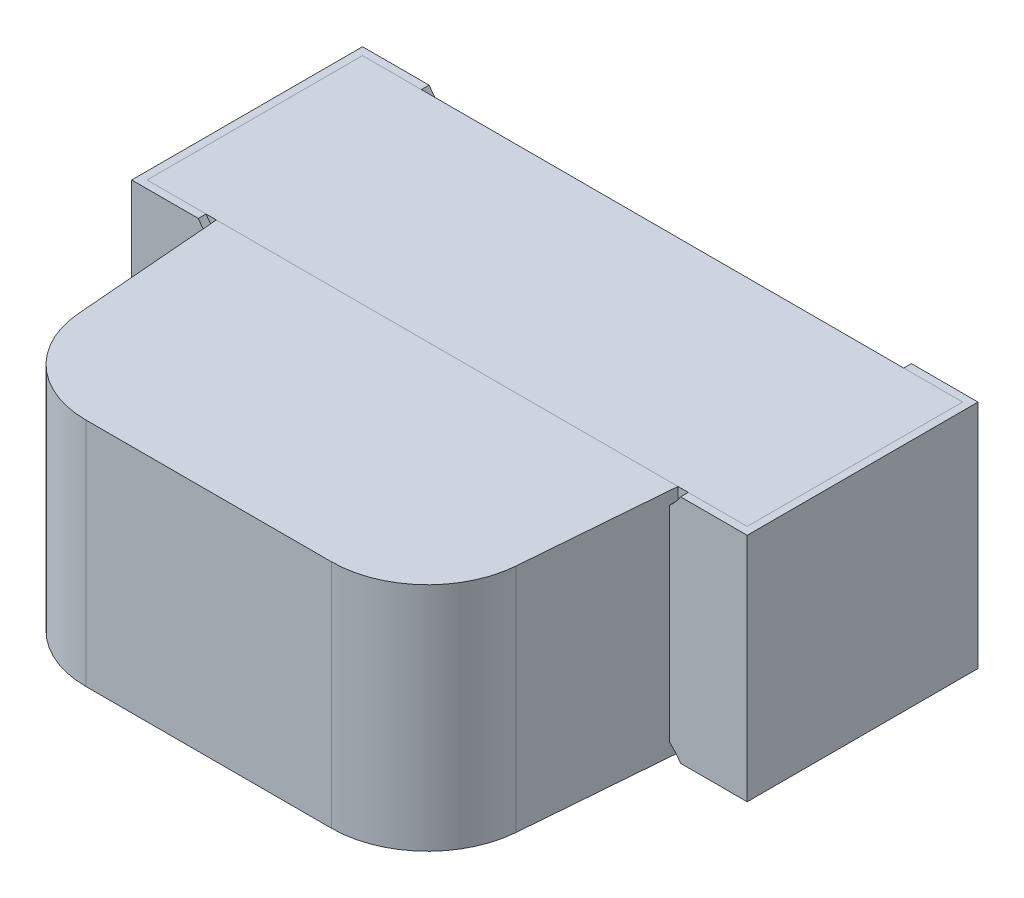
ISO-10303-21;
HEADER;
FILE_DESCRIPTION(('STEP AP214'),'2;1');
FILE_NAME('part.step','',(''),(''),'','','');
FILE_SCHEMA(('AUTOMOTIVE_DESIGN { 1 0 10303 214 1 1 1 1 }'));
ENDSEC;
DATA;
#1=APPLICATION_CONTEXT('core data for automotive mechanical design processes');
#2=APPLICATION_PROTOCOL_DEFINITION('international standard','automotive_design',2000,#1);
#3=PRODUCT_CONTEXT('',#1,'mechanical');
#4=PRODUCT('Part','Part','',(#3));
#5=PRODUCT_RELATED_PRODUCT_CATEGORY('part','',(#4));
#6=PRODUCT_DEFINITION_FORMATION('','',#4);
#7=PRODUCT_DEFINITION_CONTEXT('part definition',#1,'design');
#8=PRODUCT_DEFINITION('design','',#6,#7);
#9=PRODUCT_DEFINITION_SHAPE('','',#8);
#10=(LENGTH_UNIT() NAMED_UNIT(*) SI_UNIT(.MILLI.,.METRE.));
#11=(NAMED_UNIT(*) PLANE_ANGLE_UNIT() SI_UNIT($,.RADIAN.));
#12=(NAMED_UNIT(*) SI_UNIT($,.STERADIAN.) SOLID_ANGLE_UNIT());
#13=UNCERTAINTY_MEASURE_WITH_UNIT(LENGTH_MEASURE(1.E-05),#10,'distance_accuracy_value','');
#14=(GEOMETRIC_REPRESENTATION_CONTEXT(3) GLOBAL_UNCERTAINTY_ASSIGNED_CONTEXT((#13)) GLOBAL_UNIT_ASSIGNED_CONTEXT((#10,
#11,#12)) REPRESENTATION_CONTEXT('',''));
#15=CARTESIAN_POINT('',(0.,0.,0.));
#16=DIRECTION('',(0.,0.,1.));
#17=DIRECTION('',(1.,0.,0.));
#18=AXIS2_PLACEMENT_3D('',#15,#16,#17);
#19=CARTESIAN_POINT('',(-0.6,0.6,0.28));
#20=DIRECTION('',(0.996763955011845,0.,-0.08038418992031));
#21=DIRECTION('',(-0.08038418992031,0.,-0.996763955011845));
#22=AXIS2_PLACEMENT_3D('',#19,#20,#21);
#23=PLANE('',#22);
#24=DIRECTION('',(0.08038418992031,0.,0.996763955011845));
#25=VECTOR('',#24,1.);
#26=CARTESIAN_POINT('',(-0.6,0.,0.28));
#27=LINE('',#26,#25);
#28=CARTESIAN_POINT('',(-0.6,0.,0.28));
#29=VERTEX_POINT('',#28);
#30=CARTESIAN_POINT('',(-0.568540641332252,0.,0.670096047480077));
#31=VERTEX_POINT('',#30);
#32=EDGE_CURVE('E138',#29,#31,#27,.T.);
#33=ORIENTED_EDGE('',*,*,#32,.T.);
#34=DIRECTION('',(0.,-1.,0.));
#35=VECTOR('',#34,1.);
#36=CARTESIAN_POINT('',(-0.568540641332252,0.6,0.670096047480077));
#37=LINE('',#36,#35);
#38=CARTESIAN_POINT('',(-0.568540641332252,0.6,0.670096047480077));
#39=VERTEX_POINT('',#38);
#40=EDGE_CURVE('E12',#39,#31,#37,.T.);
#41=ORIENTED_EDGE('',*,*,#40,.F.);
#42=DIRECTION('',(0.08038418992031,0.,0.996763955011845));
#43=VECTOR('',#42,1.);
#44=CARTESIAN_POINT('',(-0.6,0.6,0.28));
#45=LINE('',#44,#43);
#46=CARTESIAN_POINT('',(-0.6,0.6,0.28));
#47=VERTEX_POINT('',#46);
#48=EDGE_CURVE('E153',#47,#39,#45,.T.);
#49=ORIENTED_EDGE('',*,*,#48,.F.);
#50=DIRECTION('',(0.,-1.,0.));
#51=VECTOR('',#50,1.);
#52=CARTESIAN_POINT('',(-0.6,0.6,0.28));
#53=LINE('',#52,#51);
#54=EDGE_CURVE('E134',#47,#29,#53,.T.);
#55=ORIENTED_EDGE('',*,*,#54,.T.);
#56=EDGE_LOOP('',(#33,#41,#49,#55));
#57=FACE_BOUND('',#56,.T.);
#58=ADVANCED_FACE('F47',(#57),#23,.F.);
#59=CARTESIAN_POINT('',(-0.31934965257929,0.6,0.65));
#60=DIRECTION('',(0.,-1.,0.));
#61=DIRECTION('',(0.,0.,-1.));
#62=AXIS2_PLACEMENT_3D('',#59,#60,#61);
#63=CYLINDRICAL_SURFACE('',#62,0.25);
#64=CARTESIAN_POINT('',(-0.31934965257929,0.,0.65));
#65=DIRECTION('',(0.,1.,0.));
#66=DIRECTION('',(0.,0.,1.));
#67=AXIS2_PLACEMENT_3D('',#64,#65,#66);
#68=CIRCLE('',#67,0.25);
#69=CARTESIAN_POINT('',(-0.31934965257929,0.,0.9));
#70=VERTEX_POINT('',#69);
#71=EDGE_CURVE('E142',#31,#70,#68,.T.);
#72=ORIENTED_EDGE('',*,*,#71,.T.);
#73=DIRECTION('',(0.,-1.,0.));
#74=VECTOR('',#73,1.);
#75=CARTESIAN_POINT('',(-0.31934965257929,0.6,0.9));
#76=LINE('',#75,#74);
#77=CARTESIAN_POINT('',(-0.31934965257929,0.6,0.9));
#78=VERTEX_POINT('',#77);
#79=EDGE_CURVE('E56',#78,#70,#76,.T.);
#80=ORIENTED_EDGE('',*,*,#79,.F.);
#81=CARTESIAN_POINT('',(-0.31934965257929,0.6,0.65));
#82=DIRECTION('',(0.,1.,0.));
#83=DIRECTION('',(0.,0.,1.));
#84=AXIS2_PLACEMENT_3D('',#81,#82,#83);
#85=CIRCLE('',#84,0.25);
#86=EDGE_CURVE('E101',#39,#78,#85,.T.);
#87=ORIENTED_EDGE('',*,*,#86,.F.);
#88=ORIENTED_EDGE('',*,*,#40,.T.);
#89=EDGE_LOOP('',(#72,#80,#87,#88));
#90=FACE_BOUND('',#89,.T.);
#91=ADVANCED_FACE('F180',(#90),#63,.T.);
#92=CARTESIAN_POINT('',(-0.31934965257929,0.6,0.9));
#93=DIRECTION('',(0.,0.,-1.));
#94=DIRECTION('',(-1.,0.,0.));
#95=AXIS2_PLACEMENT_3D('',#92,#93,#94);
#96=PLANE('',#95);
#97=DIRECTION('',(1.,0.,0.));
#98=VECTOR('',#97,1.);
#99=CARTESIAN_POINT('',(-0.31934965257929,0.,0.9));
#100=LINE('',#99,#98);
#101=CARTESIAN_POINT('',(0.319349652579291,0.,0.9));
#102=VERTEX_POINT('',#101);
#103=EDGE_CURVE('E145',#70,#102,#100,.T.);
#104=ORIENTED_EDGE('',*,*,#103,.T.);
#105=DIRECTION('',(0.,-1.,0.));
#106=VECTOR('',#105,1.);
#107=CARTESIAN_POINT('',(0.319349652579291,0.6,0.9));
#108=LINE('',#107,#106);
#109=CARTESIAN_POINT('',(0.319349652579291,0.6,0.9));
#110=VERTEX_POINT('',#109);
#111=EDGE_CURVE('E125',#110,#102,#108,.T.);
#112=ORIENTED_EDGE('',*,*,#111,.F.);
#113=DIRECTION('',(1.,0.,0.));
#114=VECTOR('',#113,1.);
#115=CARTESIAN_POINT('',(-0.31934965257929,0.6,0.9));
#116=LINE('',#115,#114);
#117=EDGE_CURVE('E114',#78,#110,#116,.T.);
#118=ORIENTED_EDGE('',*,*,#117,.F.);
#119=ORIENTED_EDGE('',*,*,#79,.T.);
#120=EDGE_LOOP('',(#104,#112,#118,#119));
#121=FACE_BOUND('',#120,.T.);
#122=ADVANCED_FACE('F163',(#121),#96,.F.);
#123=CARTESIAN_POINT('',(0.31934965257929,0.6,0.65));
#124=DIRECTION('',(0.,-1.,0.));
#125=DIRECTION('',(0.,0.,-1.));
#126=AXIS2_PLACEMENT_3D('',#123,#124,#125);
#127=CYLINDRICAL_SURFACE('',#126,0.25);
#128=CARTESIAN_POINT('',(0.31934965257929,0.,0.65));
#129=DIRECTION('',(0.,1.,0.));
#130=DIRECTION('',(0.,0.,1.));
#131=AXIS2_PLACEMENT_3D('',#128,#129,#130);
#132=CIRCLE('',#131,0.25);
#133=CARTESIAN_POINT('',(0.568540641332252,0.,0.670096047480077));
#134=VERTEX_POINT('',#133);
#135=EDGE_CURVE('E123',#102,#134,#132,.T.);
#136=ORIENTED_EDGE('',*,*,#135,.T.);
#137=DIRECTION('',(0.,-1.,0.));
#138=VECTOR('',#137,1.);
#139=CARTESIAN_POINT('',(0.568540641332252,0.6,0.670096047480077));
#140=LINE('',#139,#138);
#141=CARTESIAN_POINT('',(0.568540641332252,0.6,0.670096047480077));
#142=VERTEX_POINT('',#141);
#143=EDGE_CURVE('E120',#142,#134,#140,.T.);
#144=ORIENTED_EDGE('',*,*,#143,.F.);
#145=CARTESIAN_POINT('',(0.31934965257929,0.6,0.65));
#146=DIRECTION('',(0.,1.,0.));
#147=DIRECTION('',(0.,0.,1.));
#148=AXIS2_PLACEMENT_3D('',#145,#146,#147);
#149=CIRCLE('',#148,0.25);
#150=EDGE_CURVE('E108',#110,#142,#149,.T.);
#151=ORIENTED_EDGE('',*,*,#150,.F.);
#152=ORIENTED_EDGE('',*,*,#111,.T.);
#153=EDGE_LOOP('',(#136,#144,#151,#152));
#154=FACE_BOUND('',#153,.T.);
#155=ADVANCED_FACE('F121',(#154),#127,.T.);
#156=CARTESIAN_POINT('',(0.6,0.6,0.28));
#157=DIRECTION('',(-0.996763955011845,0.,-0.0803841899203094));
#158=DIRECTION('',(-0.0803841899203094,0.,0.996763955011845));
#159=AXIS2_PLACEMENT_3D('',#156,#157,#158);
#160=PLANE('',#159);
#161=DIRECTION('',(0.0803841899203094,0.,-0.996763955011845));
#162=VECTOR('',#161,1.);
#163=CARTESIAN_POINT('',(0.6,0.,0.28));
#164=LINE('',#163,#162);
#165=CARTESIAN_POINT('',(0.6,0.,0.28));
#166=VERTEX_POINT('',#165);
#167=EDGE_CURVE('E87',#134,#166,#164,.T.);
#168=ORIENTED_EDGE('',*,*,#167,.T.);
#169=DIRECTION('',(0.,-1.,0.));
#170=VECTOR('',#169,1.);
#171=CARTESIAN_POINT('',(0.6,0.6,0.28));
#172=LINE('',#171,#170);
#173=CARTESIAN_POINT('',(0.6,0.6,0.28));
#174=VERTEX_POINT('',#173);
#175=EDGE_CURVE('E126',#174,#166,#172,.T.);
#176=ORIENTED_EDGE('',*,*,#175,.F.);
#177=DIRECTION('',(0.0803841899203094,0.,-0.996763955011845));
#178=VECTOR('',#177,1.);
#179=CARTESIAN_POINT('',(0.6,0.6,0.28));
#180=LINE('',#179,#178);
#181=EDGE_CURVE('E112',#142,#174,#180,.T.);
#182=ORIENTED_EDGE('',*,*,#181,.F.);
#183=ORIENTED_EDGE('',*,*,#143,.T.);
#184=EDGE_LOOP('',(#168,#176,#182,#183));
#185=FACE_BOUND('',#184,.T.);
#186=ADVANCED_FACE('F128',(#185),#160,.F.);
#187=CARTESIAN_POINT('',(-0.6,0.6,0.28));
#188=DIRECTION('',(0.,0.,1.));
#189=DIRECTION('',(1.,0.,0.));
#190=AXIS2_PLACEMENT_3D('',#187,#188,#189);
#191=PLANE('',#190);
#192=DIRECTION('',(-1.,0.,0.));
#193=VECTOR('',#192,1.);
#194=CARTESIAN_POINT('',(-0.6,0.,0.28));
#195=LINE('',#194,#193);
#196=EDGE_CURVE('E93',#166,#29,#195,.T.);
#197=ORIENTED_EDGE('',*,*,#196,.T.);
#198=ORIENTED_EDGE('',*,*,#54,.F.);
#199=DIRECTION('',(-1.,0.,0.));
#200=VECTOR('',#199,1.);
#201=CARTESIAN_POINT('',(-0.6,0.6,0.28));
#202=LINE('',#201,#200);
#203=EDGE_CURVE('E64',#174,#47,#202,.T.);
#204=ORIENTED_EDGE('',*,*,#203,.F.);
#205=ORIENTED_EDGE('',*,*,#175,.T.);
#206=EDGE_LOOP('',(#197,#198,#204,#205));
#207=FACE_BOUND('',#206,.T.);
#208=ADVANCED_FACE('F170',(#207),#191,.F.);
#209=CARTESIAN_POINT('',(-0.31934965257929,0.6,0.65));
#210=DIRECTION('',(0.,1.,0.));
#211=DIRECTION('',(0.,0.,1.));
#212=AXIS2_PLACEMENT_3D('',#209,#210,#211);
#213=PLANE('',#212);
#214=ORIENTED_EDGE('',*,*,#48,.T.);
#215=ORIENTED_EDGE('',*,*,#86,.T.);
#216=ORIENTED_EDGE('',*,*,#117,.T.);
#217=ORIENTED_EDGE('',*,*,#150,.T.);
#218=ORIENTED_EDGE('',*,*,#181,.T.);
#219=ORIENTED_EDGE('',*,*,#203,.T.);
#220=EDGE_LOOP('',(#214,#215,#216,#217,#218,#219));
#221=FACE_BOUND('',#220,.T.);
#222=ADVANCED_FACE('F110',(#221),#213,.T.);
#223=CARTESIAN_POINT('',(-0.31934965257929,0.,0.65));
#224=DIRECTION('',(0.,1.,0.));
#225=DIRECTION('',(0.,0.,1.));
#226=AXIS2_PLACEMENT_3D('',#223,#224,#225);
#227=PLANE('',#226);
#228=ORIENTED_EDGE('',*,*,#32,.F.);
#229=ORIENTED_EDGE('',*,*,#196,.F.);
#230=ORIENTED_EDGE('',*,*,#167,.F.);
#231=ORIENTED_EDGE('',*,*,#135,.F.);
#232=ORIENTED_EDGE('',*,*,#103,.F.);
#233=ORIENTED_EDGE('',*,*,#71,.F.);
#234=EDGE_LOOP('',(#228,#229,#230,#231,#232,#233));
#235=FACE_BOUND('',#234,.T.);
#236=ADVANCED_FACE('F166',(#235),#227,.F.);
#237=CLOSED_SHELL('',(#58,#91,#122,#155,#186,#208,#222,#236));
#238=MANIFOLD_SOLID_BREP('B2',#237);
#239=CARTESIAN_POINT('',(0.78,0.6,0.28));
#240=DIRECTION('',(1.,0.,0.));
#241=DIRECTION('',(0.,0.,-1.));
#242=AXIS2_PLACEMENT_3D('',#239,#240,#241);
#243=PLANE('',#242);
#244=DIRECTION('',(0.,0.,1.));
#245=VECTOR('',#244,1.);
#246=CARTESIAN_POINT('',(0.78,0.,0.28));
#247=LINE('',#246,#245);
#248=CARTESIAN_POINT('',(0.78,0.,-0.28));
#249=VERTEX_POINT('',#248);
#250=CARTESIAN_POINT('',(0.78,0.,0.28));
#251=VERTEX_POINT('',#250);
#252=EDGE_CURVE('E382',#249,#251,#247,.T.);
#253=ORIENTED_EDGE('',*,*,#252,.T.);
#254=DIRECTION('',(0.,-1.,0.));
#255=VECTOR('',#254,1.);
#256=CARTESIAN_POINT('',(0.78,0.6,0.28));
#257=LINE('',#256,#255);
#258=CARTESIAN_POINT('',(0.78,0.6,0.28));
#259=VERTEX_POINT('',#258);
#260=EDGE_CURVE('E419',#259,#251,#257,.T.);
#261=ORIENTED_EDGE('',*,*,#260,.F.);
#262=DIRECTION('',(0.,0.,1.));
#263=VECTOR('',#262,1.);
#264=CARTESIAN_POINT('',(0.78,0.6,0.28));
#265=LINE('',#264,#263);
#266=CARTESIAN_POINT('',(0.78,0.6,-0.28));
#267=VERTEX_POINT('',#266);
#268=EDGE_CURVE('E392',#267,#259,#265,.T.);
#269=ORIENTED_EDGE('',*,*,#268,.F.);
#270=DIRECTION('',(0.,-1.,0.));
#271=VECTOR('',#270,1.);
#272=CARTESIAN_POINT('',(0.78,0.6,-0.28));
#273=LINE('',#272,#271);
#274=EDGE_CURVE('E393',#267,#249,#273,.T.);
#275=ORIENTED_EDGE('',*,*,#274,.T.);
#276=EDGE_LOOP('',(#253,#261,#269,#275));
#277=FACE_BOUND('',#276,.T.);
#278=ADVANCED_FACE('F258',(#277),#243,.F.);
#279=CARTESIAN_POINT('',(0.55,0.6,0.28));
#280=DIRECTION('',(0.,0.,1.));
#281=DIRECTION('',(1.,0.,0.));
#282=AXIS2_PLACEMENT_3D('',#279,#280,#281);
#283=PLANE('',#282);
#284=DIRECTION('',(0.,-1.,0.));
#285=VECTOR('',#284,1.);
#286=CARTESIAN_POINT('',(0.55,0.6,0.28));
#287=LINE('',#286,#285);
#288=CARTESIAN_POINT('',(0.55,0.538578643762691,0.28));
#289=VERTEX_POINT('',#288);
#290=CARTESIAN_POINT('',(0.55,0.0614213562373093,0.28));
#291=VERTEX_POINT('',#290);
#292=EDGE_CURVE('E415',#289,#291,#287,.T.);
#293=ORIENTED_EDGE('',*,*,#292,.F.);
#294=CARTESIAN_POINT('',(0.5,0.68,0.28));
#295=DIRECTION('',(0.,0.,1.));
#296=DIRECTION('',(1.,0.,0.));
#297=AXIS2_PLACEMENT_3D('',#294,#295,#296);
#298=CIRCLE('',#297,0.15);
#299=CARTESIAN_POINT('',(0.626885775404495,0.6,0.28));
#300=VERTEX_POINT('',#299);
#301=EDGE_CURVE('E465',#289,#300,#298,.T.);
#302=ORIENTED_EDGE('',*,*,#301,.T.);
#303=DIRECTION('',(-1.,0.,0.));
#304=VECTOR('',#303,1.);
#305=CARTESIAN_POINT('',(0.55,0.6,0.28));
#306=LINE('',#305,#304);
#307=EDGE_CURVE('E445',#259,#300,#306,.T.);
#308=ORIENTED_EDGE('',*,*,#307,.F.);
#309=ORIENTED_EDGE('',*,*,#260,.T.);
#310=DIRECTION('',(-1.,0.,0.));
#311=VECTOR('',#310,1.);
#312=CARTESIAN_POINT('',(0.55,0.,0.28));
#313=LINE('',#312,#311);
#314=CARTESIAN_POINT('',(0.626885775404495,0.,0.28));
#315=VERTEX_POINT('',#314);
#316=EDGE_CURVE('E374',#251,#315,#313,.T.);
#317=ORIENTED_EDGE('',*,*,#316,.T.);
#318=CARTESIAN_POINT('',(0.5,-0.0800000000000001,0.28));
#319=DIRECTION('',(0.,0.,1.));
#320=DIRECTION('',(1.,0.,0.));
#321=AXIS2_PLACEMENT_3D('',#318,#319,#320);
#322=CIRCLE('',#321,0.15);
#323=EDGE_CURVE('E351',#315,#291,#322,.T.);
#324=ORIENTED_EDGE('',*,*,#323,.T.);
#325=EDGE_LOOP('',(#293,#302,#308,#309,#317,#324));
#326=FACE_BOUND('',#325,.T.);
#327=ADVANCED_FACE('F481',(#326),#283,.F.);
#328=CARTESIAN_POINT('',(0.55,0.6,0.28));
#329=DIRECTION('',(1.,0.,0.));
#330=DIRECTION('',(0.,0.,-1.));
#331=AXIS2_PLACEMENT_3D('',#328,#329,#330);
#332=PLANE('',#331);
#333=DIRECTION('',(0.,-1.,0.));
#334=VECTOR('',#333,1.);
#335=CARTESIAN_POINT('',(0.55,0.6,0.3));
#336=LINE('',#335,#334);
#337=CARTESIAN_POINT('',(0.55,0.538578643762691,0.3));
#338=VERTEX_POINT('',#337);
#339=CARTESIAN_POINT('',(0.55,0.0614213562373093,0.3));
#340=VERTEX_POINT('',#339);
#341=EDGE_CURVE('E365',#338,#340,#336,.T.);
#342=ORIENTED_EDGE('',*,*,#341,.F.);
#343=DIRECTION('',(0.,0.,1.));
#344=VECTOR('',#343,1.);
#345=CARTESIAN_POINT('',(0.55,0.538578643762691,-0.3));
#346=LINE('',#345,#344);
#347=EDGE_CURVE('E460',#338,#289,#346,.F.);
#348=ORIENTED_EDGE('',*,*,#347,.T.);
#349=ORIENTED_EDGE('',*,*,#292,.T.);
#350=DIRECTION('',(0.,0.,1.));
#351=VECTOR('',#350,1.);
#352=CARTESIAN_POINT('',(0.55,0.0614213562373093,-0.3));
#353=LINE('',#352,#351);
#354=EDGE_CURVE('E533',#291,#340,#353,.T.);
#355=ORIENTED_EDGE('',*,*,#354,.T.);
#356=EDGE_LOOP('',(#342,#348,#349,#355));
#357=FACE_BOUND('',#356,.T.);
#358=ADVANCED_FACE('F492',(#357),#332,.F.);
#359=CARTESIAN_POINT('',(0.55,0.6,0.3));
#360=DIRECTION('',(0.,0.,-1.));
#361=DIRECTION('',(-1.,0.,0.));
#362=AXIS2_PLACEMENT_3D('',#359,#360,#361);
#363=PLANE('',#362);
#364=DIRECTION('',(1.,0.,0.));
#365=VECTOR('',#364,1.);
#366=CARTESIAN_POINT('',(0.55,0.6,0.3));
#367=LINE('',#366,#365);
#368=CARTESIAN_POINT('',(0.626885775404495,0.6,0.3));
#369=VERTEX_POINT('',#368);
#370=CARTESIAN_POINT('',(0.8,0.6,0.3));
#371=VERTEX_POINT('',#370);
#372=EDGE_CURVE('E442',#369,#371,#367,.T.);
#373=ORIENTED_EDGE('',*,*,#372,.F.);
#374=CARTESIAN_POINT('',(0.5,0.68,0.3));
#375=DIRECTION('',(0.,0.,1.));
#376=DIRECTION('',(-1.,0.,0.));
#377=AXIS2_PLACEMENT_3D('',#374,#375,#376);
#378=CIRCLE('',#377,0.15);
#379=EDGE_CURVE('E280',#338,#369,#378,.T.);
#380=ORIENTED_EDGE('',*,*,#379,.F.);
#381=ORIENTED_EDGE('',*,*,#341,.T.);
#382=CARTESIAN_POINT('',(0.5,-0.0800000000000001,0.3));
#383=DIRECTION('',(0.,0.,1.));
#384=DIRECTION('',(1.,0.,0.));
#385=AXIS2_PLACEMENT_3D('',#382,#383,#384);
#386=CIRCLE('',#385,0.15);
#387=CARTESIAN_POINT('',(0.626885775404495,0.,0.3));
#388=VERTEX_POINT('',#387);
#389=EDGE_CURVE('E348',#388,#340,#386,.T.);
#390=ORIENTED_EDGE('',*,*,#389,.F.);
#391=DIRECTION('',(1.,0.,0.));
#392=VECTOR('',#391,1.);
#393=CARTESIAN_POINT('',(0.55,0.,0.3));
#394=LINE('',#393,#392);
#395=CARTESIAN_POINT('',(0.8,0.,0.3));
#396=VERTEX_POINT('',#395);
#397=EDGE_CURVE('E362',#388,#396,#394,.T.);
#398=ORIENTED_EDGE('',*,*,#397,.T.);
#399=DIRECTION('',(0.,-1.,0.));
#400=VECTOR('',#399,1.);
#401=CARTESIAN_POINT('',(0.8,0.6,0.3));
#402=LINE('',#401,#400);
#403=EDGE_CURVE('E410',#371,#396,#402,.T.);
#404=ORIENTED_EDGE('',*,*,#403,.F.);
#405=EDGE_LOOP('',(#373,#380,#381,#390,#398,#404));
#406=FACE_BOUND('',#405,.T.);
#407=ADVANCED_FACE('F360',(#406),#363,.F.);
#408=CARTESIAN_POINT('',(0.8,0.6,0.3));
#409=DIRECTION('',(-1.,0.,0.));
#410=DIRECTION('',(0.,0.,1.));
#411=AXIS2_PLACEMENT_3D('',#408,#409,#410);
#412=PLANE('',#411);
#413=DIRECTION('',(0.,0.,-1.));
#414=VECTOR('',#413,1.);
#415=CARTESIAN_POINT('',(0.8,0.,0.3));
#416=LINE('',#415,#414);
#417=CARTESIAN_POINT('',(0.8,0.,-0.3));
#418=VERTEX_POINT('',#417);
#419=EDGE_CURVE('E372',#396,#418,#416,.T.);
#420=ORIENTED_EDGE('',*,*,#419,.T.);
#421=DIRECTION('',(0.,-1.,0.));
#422=VECTOR('',#421,1.);
#423=CARTESIAN_POINT('',(0.8,0.6,-0.3));
#424=LINE('',#423,#422);
#425=CARTESIAN_POINT('',(0.8,0.6,-0.3));
#426=VERTEX_POINT('',#425);
#427=EDGE_CURVE('E406',#426,#418,#424,.T.);
#428=ORIENTED_EDGE('',*,*,#427,.F.);
#429=DIRECTION('',(0.,0.,-1.));
#430=VECTOR('',#429,1.);
#431=CARTESIAN_POINT('',(0.8,0.6,0.3));
#432=LINE('',#431,#430);
#433=EDGE_CURVE('E441',#371,#426,#432,.T.);
#434=ORIENTED_EDGE('',*,*,#433,.F.);
#435=ORIENTED_EDGE('',*,*,#403,.T.);
#436=EDGE_LOOP('',(#420,#428,#434,#435));
#437=FACE_BOUND('',#436,.T.);
#438=ADVANCED_FACE('F440',(#437),#412,.F.);
#439=CARTESIAN_POINT('',(0.8,0.6,-0.3));
#440=DIRECTION('',(0.,0.,1.));
#441=DIRECTION('',(1.,0.,0.));
#442=AXIS2_PLACEMENT_3D('',#439,#440,#441);
#443=PLANE('',#442);
#444=DIRECTION('',(0.,-1.,0.));
#445=VECTOR('',#444,1.);
#446=CARTESIAN_POINT('',(0.55,0.6,-0.3));
#447=LINE('',#446,#445);
#448=CARTESIAN_POINT('',(0.55,0.538578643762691,-0.3));
#449=VERTEX_POINT('',#448);
#450=CARTESIAN_POINT('',(0.55,0.0614213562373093,-0.3));
#451=VERTEX_POINT('',#450);
#452=EDGE_CURVE('E402',#449,#451,#447,.T.);
#453=ORIENTED_EDGE('',*,*,#452,.F.);
#454=CARTESIAN_POINT('',(0.5,0.68,-0.3));
#455=DIRECTION('',(0.,0.,1.));
#456=DIRECTION('',(-1.,0.,0.));
#457=AXIS2_PLACEMENT_3D('',#454,#455,#456);
#458=CIRCLE('',#457,0.15);
#459=CARTESIAN_POINT('',(0.626885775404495,0.6,-0.3));
#460=VERTEX_POINT('',#459);
#461=EDGE_CURVE('E523',#449,#460,#458,.T.);
#462=ORIENTED_EDGE('',*,*,#461,.T.);
#463=DIRECTION('',(-1.,0.,0.));
#464=VECTOR('',#463,1.);
#465=CARTESIAN_POINT('',(0.8,0.6,-0.3));
#466=LINE('',#465,#464);
#467=EDGE_CURVE('E437',#426,#460,#466,.T.);
#468=ORIENTED_EDGE('',*,*,#467,.F.);
#469=ORIENTED_EDGE('',*,*,#427,.T.);
#470=DIRECTION('',(-1.,0.,0.));
#471=VECTOR('',#470,1.);
#472=CARTESIAN_POINT('',(0.8,0.,-0.3));
#473=LINE('',#472,#471);
#474=CARTESIAN_POINT('',(0.626885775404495,0.,-0.3));
#475=VERTEX_POINT('',#474);
#476=EDGE_CURVE('E379',#418,#475,#473,.T.);
#477=ORIENTED_EDGE('',*,*,#476,.T.);
#478=CARTESIAN_POINT('',(0.5,-0.0800000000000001,-0.3));
#479=DIRECTION('',(0.,0.,1.));
#480=DIRECTION('',(1.,0.,0.));
#481=AXIS2_PLACEMENT_3D('',#478,#479,#480);
#482=CIRCLE('',#481,0.15);
#483=EDGE_CURVE('E367',#475,#451,#482,.T.);
#484=ORIENTED_EDGE('',*,*,#483,.T.);
#485=EDGE_LOOP('',(#453,#462,#468,#469,#477,#484));
#486=FACE_BOUND('',#485,.T.);
#487=ADVANCED_FACE('F432',(#486),#443,.F.);
#488=CARTESIAN_POINT('',(0.55,0.6,-0.3));
#489=DIRECTION('',(1.,0.,0.));
#490=DIRECTION('',(0.,0.,-1.));
#491=AXIS2_PLACEMENT_3D('',#488,#489,#490);
#492=PLANE('',#491);
#493=DIRECTION('',(0.,-1.,0.));
#494=VECTOR('',#493,1.);
#495=CARTESIAN_POINT('',(0.55,0.6,-0.28));
#496=LINE('',#495,#494);
#497=CARTESIAN_POINT('',(0.55,0.538578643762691,-0.28));
#498=VERTEX_POINT('',#497);
#499=CARTESIAN_POINT('',(0.55,0.0614213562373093,-0.28));
#500=VERTEX_POINT('',#499);
#501=EDGE_CURVE('E397',#498,#500,#496,.T.);
#502=ORIENTED_EDGE('',*,*,#501,.F.);
#503=DIRECTION('',(0.,0.,1.));
#504=VECTOR('',#503,1.);
#505=CARTESIAN_POINT('',(0.55,0.538578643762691,-0.300000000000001));
#506=LINE('',#505,#504);
#507=EDGE_CURVE('E471',#498,#449,#506,.F.);
#508=ORIENTED_EDGE('',*,*,#507,.T.);
#509=ORIENTED_EDGE('',*,*,#452,.T.);
#510=DIRECTION('',(0.,0.,1.));
#511=VECTOR('',#510,1.);
#512=CARTESIAN_POINT('',(0.55,0.0614213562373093,-0.300000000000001));
#513=LINE('',#512,#511);
#514=EDGE_CURVE('E520',#451,#500,#513,.T.);
#515=ORIENTED_EDGE('',*,*,#514,.T.);
#516=EDGE_LOOP('',(#502,#508,#509,#515));
#517=FACE_BOUND('',#516,.T.);
#518=ADVANCED_FACE('F503',(#517),#492,.F.);
#519=CARTESIAN_POINT('',(0.78,0.6,-0.28));
#520=DIRECTION('',(0.,0.,-1.));
#521=DIRECTION('',(-1.,0.,0.));
#522=AXIS2_PLACEMENT_3D('',#519,#520,#521);
#523=PLANE('',#522);
#524=DIRECTION('',(1.,0.,0.));
#525=VECTOR('',#524,1.);
#526=CARTESIAN_POINT('',(0.78,0.6,-0.28));
#527=LINE('',#526,#525);
#528=CARTESIAN_POINT('',(0.626885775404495,0.6,-0.28));
#529=VERTEX_POINT('',#528);
#530=EDGE_CURVE('E398',#529,#267,#527,.T.);
#531=ORIENTED_EDGE('',*,*,#530,.F.);
#532=CARTESIAN_POINT('',(0.5,0.68,-0.28));
#533=DIRECTION('',(0.,0.,-1.));
#534=DIRECTION('',(-1.,0.,0.));
#535=AXIS2_PLACEMENT_3D('',#532,#533,#534);
#536=CIRCLE('',#535,0.15);
#537=EDGE_CURVE('E273',#529,#498,#536,.T.);
#538=ORIENTED_EDGE('',*,*,#537,.T.);
#539=ORIENTED_EDGE('',*,*,#501,.T.);
#540=CARTESIAN_POINT('',(0.5,-0.0800000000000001,-0.28));
#541=DIRECTION('',(0.,0.,-1.));
#542=DIRECTION('',(-1.,0.,0.));
#543=AXIS2_PLACEMENT_3D('',#540,#541,#542);
#544=CIRCLE('',#543,0.15);
#545=CARTESIAN_POINT('',(0.626885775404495,0.,-0.28));
#546=VERTEX_POINT('',#545);
#547=EDGE_CURVE('E527',#500,#546,#544,.T.);
#548=ORIENTED_EDGE('',*,*,#547,.T.);
#549=DIRECTION('',(1.,0.,0.));
#550=VECTOR('',#549,1.);
#551=CARTESIAN_POINT('',(0.78,0.,-0.28));
#552=LINE('',#551,#550);
#553=EDGE_CURVE('E389',#546,#249,#552,.T.);
#554=ORIENTED_EDGE('',*,*,#553,.T.);
#555=ORIENTED_EDGE('',*,*,#274,.F.);
#556=EDGE_LOOP('',(#531,#538,#539,#548,#554,#555));
#557=FACE_BOUND('',#556,.T.);
#558=ADVANCED_FACE('F506',(#557),#523,.F.);
#559=CARTESIAN_POINT('',(0.,0.6,0.));
#560=DIRECTION('',(0.,1.,0.));
#561=DIRECTION('',(0.,0.,1.));
#562=AXIS2_PLACEMENT_3D('',#559,#560,#561);
#563=PLANE('',#562);
#564=DIRECTION('',(0.,0.,1.));
#565=VECTOR('',#564,1.);
#566=CARTESIAN_POINT('',(0.626885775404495,0.6,-0.3));
#567=LINE('',#566,#565);
#568=EDGE_CURVE('E45',#369,#300,#567,.F.);
#569=ORIENTED_EDGE('',*,*,#568,.F.);
#570=ORIENTED_EDGE('',*,*,#372,.T.);
#571=ORIENTED_EDGE('',*,*,#433,.T.);
#572=ORIENTED_EDGE('',*,*,#467,.T.);
#573=EDGE_CURVE('E261',#529,#460,#567,.F.);
#574=ORIENTED_EDGE('',*,*,#573,.F.);
#575=ORIENTED_EDGE('',*,*,#530,.T.);
#576=ORIENTED_EDGE('',*,*,#268,.T.);
#577=ORIENTED_EDGE('',*,*,#307,.T.);
#578=EDGE_LOOP('',(#569,#570,#571,#572,#574,#575,#576,#577));
#579=FACE_BOUND('',#578,.T.);
#580=ADVANCED_FACE('F477',(#579),#563,.T.);
#581=CARTESIAN_POINT('',(0.,0.,0.));
#582=DIRECTION('',(0.,1.,0.));
#583=DIRECTION('',(0.,0.,1.));
#584=AXIS2_PLACEMENT_3D('',#581,#582,#583);
#585=PLANE('',#584);
#586=ORIENTED_EDGE('',*,*,#397,.F.);
#587=DIRECTION('',(0.,0.,1.));
#588=VECTOR('',#587,1.);
#589=CARTESIAN_POINT('',(0.626885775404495,0.,-0.3));
#590=LINE('',#589,#588);
#591=EDGE_CURVE('E345',#388,#315,#590,.F.);
#592=ORIENTED_EDGE('',*,*,#591,.T.);
#593=ORIENTED_EDGE('',*,*,#316,.F.);
#594=ORIENTED_EDGE('',*,*,#252,.F.);
#595=ORIENTED_EDGE('',*,*,#553,.F.);
#596=EDGE_CURVE('E356',#546,#475,#590,.F.);
#597=ORIENTED_EDGE('',*,*,#596,.T.);
#598=ORIENTED_EDGE('',*,*,#476,.F.);
#599=ORIENTED_EDGE('',*,*,#419,.F.);
#600=EDGE_LOOP('',(#586,#592,#593,#594,#595,#597,#598,#599));
#601=FACE_BOUND('',#600,.T.);
#602=ADVANCED_FACE('F370',(#601),#585,.F.);
#603=CARTESIAN_POINT('',(0.5,-0.0800000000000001,-0.3));
#604=DIRECTION('',(0.,0.,1.));
#605=DIRECTION('',(1.,0.,0.));
#606=AXIS2_PLACEMENT_3D('',#603,#604,#605);
#607=CYLINDRICAL_SURFACE('',#606,0.15);
#608=ORIENTED_EDGE('',*,*,#483,.F.);
#609=ORIENTED_EDGE('',*,*,#596,.F.);
#610=ORIENTED_EDGE('',*,*,#547,.F.);
#611=ORIENTED_EDGE('',*,*,#514,.F.);
#612=EDGE_LOOP('',(#608,#609,#610,#611));
#613=FACE_BOUND('',#612,.T.);
#614=ADVANCED_FACE('F513',(#613),#607,.F.);
#615=ORIENTED_EDGE('',*,*,#323,.F.);
#616=ORIENTED_EDGE('',*,*,#591,.F.);
#617=ORIENTED_EDGE('',*,*,#389,.T.);
#618=ORIENTED_EDGE('',*,*,#354,.F.);
#619=EDGE_LOOP('',(#615,#616,#617,#618));
#620=FACE_BOUND('',#619,.T.);
#621=ADVANCED_FACE('F347',(#620),#607,.F.);
#622=CARTESIAN_POINT('',(0.5,0.68,-0.3));
#623=DIRECTION('',(0.,0.,1.));
#624=DIRECTION('',(1.,0.,0.));
#625=AXIS2_PLACEMENT_3D('',#622,#623,#624);
#626=CYLINDRICAL_SURFACE('',#625,0.15);
#627=ORIENTED_EDGE('',*,*,#537,.F.);
#628=ORIENTED_EDGE('',*,*,#573,.T.);
#629=ORIENTED_EDGE('',*,*,#461,.F.);
#630=ORIENTED_EDGE('',*,*,#507,.F.);
#631=EDGE_LOOP('',(#627,#628,#629,#630));
#632=FACE_BOUND('',#631,.T.);
#633=ADVANCED_FACE('F484',(#632),#626,.F.);
#634=ORIENTED_EDGE('',*,*,#379,.T.);
#635=ORIENTED_EDGE('',*,*,#568,.T.);
#636=ORIENTED_EDGE('',*,*,#301,.F.);
#637=ORIENTED_EDGE('',*,*,#347,.F.);
#638=EDGE_LOOP('',(#634,#635,#636,#637));
#639=FACE_BOUND('',#638,.T.);
#640=ADVANCED_FACE('F482',(#639),#626,.F.);
#641=CLOSED_SHELL('',(#278,#327,#358,#407,#438,#487,#518,#558,#580,#602,#614,#621,#633,#640));
#642=MANIFOLD_SOLID_BREP('B6',#641);
#643=CARTESIAN_POINT('',(-0.55,0.6,-0.28));
#644=DIRECTION('',(0.,0.,-1.));
#645=DIRECTION('',(-1.,0.,0.));
#646=AXIS2_PLACEMENT_3D('',#643,#644,#645);
#647=PLANE('',#646);
#648=DIRECTION('',(0.,-1.,0.));
#649=VECTOR('',#648,1.);
#650=CARTESIAN_POINT('',(-0.55,0.6,-0.28));
#651=LINE('',#650,#649);
#652=CARTESIAN_POINT('',(-0.55,0.538578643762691,-0.28));
#653=VERTEX_POINT('',#652);
#654=CARTESIAN_POINT('',(-0.55,0.0614213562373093,-0.28));
#655=VERTEX_POINT('',#654);
#656=EDGE_CURVE('E780',#653,#655,#651,.T.);
#657=ORIENTED_EDGE('',*,*,#656,.F.);
#658=CARTESIAN_POINT('',(-0.5,0.68,-0.28));
#659=DIRECTION('',(0.,0.,-1.));
#660=DIRECTION('',(-1.,0.,0.));
#661=AXIS2_PLACEMENT_3D('',#658,#659,#660);
#662=CIRCLE('',#661,0.15);
#663=CARTESIAN_POINT('',(-0.626885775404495,0.6,-0.28));
#664=VERTEX_POINT('',#663);
#665=EDGE_CURVE('E860',#653,#664,#662,.T.);
#666=ORIENTED_EDGE('',*,*,#665,.T.);
#667=DIRECTION('',(1.,0.,0.));
#668=VECTOR('',#667,1.);
#669=CARTESIAN_POINT('',(-0.55,0.6,-0.28));
#670=LINE('',#669,#668);
#671=CARTESIAN_POINT('',(-0.78,0.6,-0.28));
#672=VERTEX_POINT('',#671);
#673=EDGE_CURVE('E842',#672,#664,#670,.T.);
#674=ORIENTED_EDGE('',*,*,#673,.F.);
#675=DIRECTION('',(0.,-1.,0.));
#676=VECTOR('',#675,1.);
#677=CARTESIAN_POINT('',(-0.78,0.6,-0.28));
#678=LINE('',#677,#676);
#679=CARTESIAN_POINT('',(-0.78,0.,-0.28));
#680=VERTEX_POINT('',#679);
#681=EDGE_CURVE('E825',#672,#680,#678,.T.);
#682=ORIENTED_EDGE('',*,*,#681,.T.);
#683=DIRECTION('',(1.,0.,0.));
#684=VECTOR('',#683,1.);
#685=CARTESIAN_POINT('',(-0.55,0.,-0.28));
#686=LINE('',#685,#684);
#687=CARTESIAN_POINT('',(-0.626885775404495,0.,-0.28));
#688=VERTEX_POINT('',#687);
#689=EDGE_CURVE('E826',#680,#688,#686,.T.);
#690=ORIENTED_EDGE('',*,*,#689,.T.);
#691=CARTESIAN_POINT('',(-0.5,-0.0800000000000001,-0.28));
#692=DIRECTION('',(0.,0.,-1.));
#693=DIRECTION('',(-1.,0.,0.));
#694=AXIS2_PLACEMENT_3D('',#691,#692,#693);
#695=CIRCLE('',#694,0.15);
#696=EDGE_CURVE('E743',#688,#655,#695,.T.);
#697=ORIENTED_EDGE('',*,*,#696,.T.);
#698=EDGE_LOOP('',(#657,#666,#674,#682,#690,#697));
#699=FACE_BOUND('',#698,.T.);
#700=ADVANCED_FACE('F644',(#699),#647,.F.);
#701=CARTESIAN_POINT('',(-0.55,0.6,-0.3));
#702=DIRECTION('',(-1.,0.,0.));
#703=DIRECTION('',(0.,0.,1.));
#704=AXIS2_PLACEMENT_3D('',#701,#702,#703);
#705=PLANE('',#704);
#706=DIRECTION('',(0.,-1.,0.));
#707=VECTOR('',#706,1.);
#708=CARTESIAN_POINT('',(-0.55,0.6,-0.3));
#709=LINE('',#708,#707);
#710=CARTESIAN_POINT('',(-0.55,0.538578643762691,-0.3));
#711=VERTEX_POINT('',#710);
#712=CARTESIAN_POINT('',(-0.55,0.0614213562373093,-0.3));
#713=VERTEX_POINT('',#712);
#714=EDGE_CURVE('E776',#711,#713,#709,.T.);
#715=ORIENTED_EDGE('',*,*,#714,.F.);
#716=DIRECTION('',(0.,0.,1.));
#717=VECTOR('',#716,1.);
#718=CARTESIAN_POINT('',(-0.55,0.538578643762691,-0.300000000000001));
#719=LINE('',#718,#717);
#720=EDGE_CURVE('E830',#711,#653,#719,.T.);
#721=ORIENTED_EDGE('',*,*,#720,.T.);
#722=ORIENTED_EDGE('',*,*,#656,.T.);
#723=DIRECTION('',(0.,0.,1.));
#724=VECTOR('',#723,1.);
#725=CARTESIAN_POINT('',(-0.55,0.0614213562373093,-0.300000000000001));
#726=LINE('',#725,#724);
#727=EDGE_CURVE('E873',#655,#713,#726,.F.);
#728=ORIENTED_EDGE('',*,*,#727,.T.);
#729=EDGE_LOOP('',(#715,#721,#722,#728));
#730=FACE_BOUND('',#729,.T.);
#731=ADVANCED_FACE('F889',(#730),#705,.F.);
#732=CARTESIAN_POINT('',(-0.55,0.6,-0.3));
#733=DIRECTION('',(0.,0.,1.));
#734=DIRECTION('',(1.,0.,0.));
#735=AXIS2_PLACEMENT_3D('',#732,#733,#734);
#736=PLANE('',#735);
#737=DIRECTION('',(-1.,0.,0.));
#738=VECTOR('',#737,1.);
#739=CARTESIAN_POINT('',(-0.55,0.6,-0.3));
#740=LINE('',#739,#738);
#741=CARTESIAN_POINT('',(-0.626885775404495,0.6,-0.3));
#742=VERTEX_POINT('',#741);
#743=CARTESIAN_POINT('',(-0.8,0.6,-0.3));
#744=VERTEX_POINT('',#743);
#745=EDGE_CURVE('E819',#742,#744,#740,.T.);
#746=ORIENTED_EDGE('',*,*,#745,.F.);
#747=CARTESIAN_POINT('',(-0.5,0.68,-0.3));
#748=DIRECTION('',(0.,0.,1.));
#749=DIRECTION('',(1.,0.,0.));
#750=AXIS2_PLACEMENT_3D('',#747,#748,#749);
#751=CIRCLE('',#750,0.15);
#752=EDGE_CURVE('E666',#742,#711,#751,.T.);
#753=ORIENTED_EDGE('',*,*,#752,.T.);
#754=ORIENTED_EDGE('',*,*,#714,.T.);
#755=CARTESIAN_POINT('',(-0.5,-0.0800000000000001,-0.3));
#756=DIRECTION('',(0.,0.,1.));
#757=DIRECTION('',(-1.,0.,0.));
#758=AXIS2_PLACEMENT_3D('',#755,#756,#757);
#759=CIRCLE('',#758,0.15);
#760=CARTESIAN_POINT('',(-0.626885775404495,0.,-0.3));
#761=VERTEX_POINT('',#760);
#762=EDGE_CURVE('E755',#713,#761,#759,.T.);
#763=ORIENTED_EDGE('',*,*,#762,.T.);
#764=DIRECTION('',(-1.,0.,0.));
#765=VECTOR('',#764,1.);
#766=CARTESIAN_POINT('',(-0.55,0.,-0.3));
#767=LINE('',#766,#765);
#768=CARTESIAN_POINT('',(-0.8,0.,-0.3));
#769=VERTEX_POINT('',#768);
#770=EDGE_CURVE('E829',#761,#769,#767,.T.);
#771=ORIENTED_EDGE('',*,*,#770,.T.);
#772=DIRECTION('',(0.,-1.,0.));
#773=VECTOR('',#772,1.);
#774=CARTESIAN_POINT('',(-0.8,0.6,-0.3));
#775=LINE('',#774,#773);
#776=EDGE_CURVE('E766',#744,#769,#775,.T.);
#777=ORIENTED_EDGE('',*,*,#776,.F.);
#778=EDGE_LOOP('',(#746,#753,#754,#763,#771,#777));
#779=FACE_BOUND('',#778,.T.);
#780=ADVANCED_FACE('F886',(#779),#736,.F.);
#781=CARTESIAN_POINT('',(-0.8,0.6,-0.3));
#782=DIRECTION('',(1.,0.,0.));
#783=DIRECTION('',(0.,0.,-1.));
#784=AXIS2_PLACEMENT_3D('',#781,#782,#783);
#785=PLANE('',#784);
#786=DIRECTION('',(0.,0.,1.));
#787=VECTOR('',#786,1.);
#788=CARTESIAN_POINT('',(-0.8,0.,-0.3));
#789=LINE('',#788,#787);
#790=CARTESIAN_POINT('',(-0.8,0.,0.3));
#791=VERTEX_POINT('',#790);
#792=EDGE_CURVE('E833',#769,#791,#789,.T.);
#793=ORIENTED_EDGE('',*,*,#792,.T.);
#794=DIRECTION('',(0.,-1.,0.));
#795=VECTOR('',#794,1.);
#796=CARTESIAN_POINT('',(-0.8,0.6,0.3));
#797=LINE('',#796,#795);
#798=CARTESIAN_POINT('',(-0.8,0.6,0.3));
#799=VERTEX_POINT('',#798);
#800=EDGE_CURVE('E761',#799,#791,#797,.T.);
#801=ORIENTED_EDGE('',*,*,#800,.F.);
#802=DIRECTION('',(0.,0.,1.));
#803=VECTOR('',#802,1.);
#804=CARTESIAN_POINT('',(-0.8,0.6,-0.3));
#805=LINE('',#804,#803);
#806=EDGE_CURVE('E810',#744,#799,#805,.T.);
#807=ORIENTED_EDGE('',*,*,#806,.F.);
#808=ORIENTED_EDGE('',*,*,#776,.T.);
#809=EDGE_LOOP('',(#793,#801,#807,#808));
#810=FACE_BOUND('',#809,.T.);
#811=ADVANCED_FACE('F894',(#810),#785,.F.);
#812=CARTESIAN_POINT('',(-0.8,0.6,0.3));
#813=DIRECTION('',(0.,0.,-1.));
#814=DIRECTION('',(-1.,0.,0.));
#815=AXIS2_PLACEMENT_3D('',#812,#813,#814);
#816=PLANE('',#815);
#817=DIRECTION('',(0.,-1.,0.));
#818=VECTOR('',#817,1.);
#819=CARTESIAN_POINT('',(-0.55,0.6,0.3));
#820=LINE('',#819,#818);
#821=CARTESIAN_POINT('',(-0.55,0.538578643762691,0.3));
#822=VERTEX_POINT('',#821);
#823=CARTESIAN_POINT('',(-0.55,0.0614213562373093,0.3));
#824=VERTEX_POINT('',#823);
#825=EDGE_CURVE('E750',#822,#824,#820,.T.);
#826=ORIENTED_EDGE('',*,*,#825,.F.);
#827=CARTESIAN_POINT('',(-0.5,0.68,0.3));
#828=DIRECTION('',(0.,0.,1.));
#829=DIRECTION('',(1.,0.,0.));
#830=AXIS2_PLACEMENT_3D('',#827,#828,#829);
#831=CIRCLE('',#830,0.15);
#832=CARTESIAN_POINT('',(-0.626885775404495,0.6,0.3));
#833=VERTEX_POINT('',#832);
#834=EDGE_CURVE('E801',#833,#822,#831,.T.);
#835=ORIENTED_EDGE('',*,*,#834,.F.);
#836=DIRECTION('',(1.,0.,0.));
#837=VECTOR('',#836,1.);
#838=CARTESIAN_POINT('',(-0.8,0.6,0.3));
#839=LINE('',#838,#837);
#840=EDGE_CURVE('E806',#799,#833,#839,.T.);
#841=ORIENTED_EDGE('',*,*,#840,.F.);
#842=ORIENTED_EDGE('',*,*,#800,.T.);
#843=DIRECTION('',(1.,0.,0.));
#844=VECTOR('',#843,1.);
#845=CARTESIAN_POINT('',(-0.8,0.,0.3));
#846=LINE('',#845,#844);
#847=CARTESIAN_POINT('',(-0.626885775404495,0.,0.3));
#848=VERTEX_POINT('',#847);
#849=EDGE_CURVE('E753',#791,#848,#846,.T.);
#850=ORIENTED_EDGE('',*,*,#849,.T.);
#851=CARTESIAN_POINT('',(-0.5,-0.0800000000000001,0.3));
#852=DIRECTION('',(0.,0.,1.));
#853=DIRECTION('',(-1.,0.,0.));
#854=AXIS2_PLACEMENT_3D('',#851,#852,#853);
#855=CIRCLE('',#854,0.15);
#856=EDGE_CURVE('E734',#824,#848,#855,.T.);
#857=ORIENTED_EDGE('',*,*,#856,.F.);
#858=EDGE_LOOP('',(#826,#835,#841,#842,#850,#857));
#859=FACE_BOUND('',#858,.T.);
#860=ADVANCED_FACE('F748',(#859),#816,.F.);
#861=CARTESIAN_POINT('',(-0.55,0.6,0.28));
#862=DIRECTION('',(-1.,0.,0.));
#863=DIRECTION('',(0.,0.,1.));
#864=AXIS2_PLACEMENT_3D('',#861,#862,#863);
#865=PLANE('',#864);
#866=DIRECTION('',(0.,-1.,0.));
#867=VECTOR('',#866,1.);
#868=CARTESIAN_POINT('',(-0.55,0.6,0.28));
#869=LINE('',#868,#867);
#870=CARTESIAN_POINT('',(-0.55,0.538578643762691,0.28));
#871=VERTEX_POINT('',#870);
#872=CARTESIAN_POINT('',(-0.55,0.0614213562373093,0.28));
#873=VERTEX_POINT('',#872);
#874=EDGE_CURVE('E762',#871,#873,#869,.T.);
#875=ORIENTED_EDGE('',*,*,#874,.F.);
#876=DIRECTION('',(0.,0.,1.));
#877=VECTOR('',#876,1.);
#878=CARTESIAN_POINT('',(-0.55,0.538578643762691,-0.3));
#879=LINE('',#878,#877);
#880=EDGE_CURVE('E759',#871,#822,#879,.T.);
#881=ORIENTED_EDGE('',*,*,#880,.T.);
#882=ORIENTED_EDGE('',*,*,#825,.T.);
#883=DIRECTION('',(0.,0.,1.));
#884=VECTOR('',#883,1.);
#885=CARTESIAN_POINT('',(-0.55,0.0614213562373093,-0.3));
#886=LINE('',#885,#884);
#887=EDGE_CURVE('E731',#824,#873,#886,.F.);
#888=ORIENTED_EDGE('',*,*,#887,.T.);
#889=EDGE_LOOP('',(#875,#881,#882,#888));
#890=FACE_BOUND('',#889,.T.);
#891=ADVANCED_FACE('F758',(#890),#865,.F.);
#892=CARTESIAN_POINT('',(-0.78,0.6,0.28));
#893=DIRECTION('',(0.,0.,1.));
#894=DIRECTION('',(1.,0.,0.));
#895=AXIS2_PLACEMENT_3D('',#892,#893,#894);
#896=PLANE('',#895);
#897=DIRECTION('',(-1.,0.,0.));
#898=VECTOR('',#897,1.);
#899=CARTESIAN_POINT('',(-0.78,0.6,0.28));
#900=LINE('',#899,#898);
#901=CARTESIAN_POINT('',(-0.626885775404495,0.6,0.28));
#902=VERTEX_POINT('',#901);
#903=CARTESIAN_POINT('',(-0.78,0.6,0.28));
#904=VERTEX_POINT('',#903);
#905=EDGE_CURVE('E812',#902,#904,#900,.T.);
#906=ORIENTED_EDGE('',*,*,#905,.F.);
#907=CARTESIAN_POINT('',(-0.5,0.68,0.28));
#908=DIRECTION('',(0.,0.,1.));
#909=DIRECTION('',(1.,0.,0.));
#910=AXIS2_PLACEMENT_3D('',#907,#908,#909);
#911=CIRCLE('',#910,0.15);
#912=EDGE_CURVE('E659',#902,#871,#911,.T.);
#913=ORIENTED_EDGE('',*,*,#912,.T.);
#914=ORIENTED_EDGE('',*,*,#874,.T.);
#915=CARTESIAN_POINT('',(-0.5,-0.0800000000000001,0.28));
#916=DIRECTION('',(0.,0.,1.));
#917=DIRECTION('',(1.,0.,0.));
#918=AXIS2_PLACEMENT_3D('',#915,#916,#917);
#919=CIRCLE('',#918,0.15);
#920=CARTESIAN_POINT('',(-0.626885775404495,0.,0.28));
#921=VERTEX_POINT('',#920);
#922=EDGE_CURVE('E737',#873,#921,#919,.T.);
#923=ORIENTED_EDGE('',*,*,#922,.T.);
#924=DIRECTION('',(-1.,0.,0.));
#925=VECTOR('',#924,1.);
#926=CARTESIAN_POINT('',(-0.78,0.,0.28));
#927=LINE('',#926,#925);
#928=CARTESIAN_POINT('',(-0.78,0.,0.28));
#929=VERTEX_POINT('',#928);
#930=EDGE_CURVE('E837',#921,#929,#927,.T.);
#931=ORIENTED_EDGE('',*,*,#930,.T.);
#932=DIRECTION('',(0.,-1.,0.));
#933=VECTOR('',#932,1.);
#934=CARTESIAN_POINT('',(-0.78,0.6,0.28));
#935=LINE('',#934,#933);
#936=EDGE_CURVE('E769',#904,#929,#935,.T.);
#937=ORIENTED_EDGE('',*,*,#936,.F.);
#938=EDGE_LOOP('',(#906,#913,#914,#923,#931,#937));
#939=FACE_BOUND('',#938,.T.);
#940=ADVANCED_FACE('F928',(#939),#896,.F.);
#941=CARTESIAN_POINT('',(-0.78,0.6,-0.28));
#942=DIRECTION('',(-1.,0.,0.));
#943=DIRECTION('',(0.,0.,1.));
#944=AXIS2_PLACEMENT_3D('',#941,#942,#943);
#945=PLANE('',#944);
#946=DIRECTION('',(0.,0.,-1.));
#947=VECTOR('',#946,1.);
#948=CARTESIAN_POINT('',(-0.78,0.,-0.28));
#949=LINE('',#948,#947);
#950=EDGE_CURVE('E839',#929,#680,#949,.T.);
#951=ORIENTED_EDGE('',*,*,#950,.T.);
#952=ORIENTED_EDGE('',*,*,#681,.F.);
#953=DIRECTION('',(0.,0.,-1.));
#954=VECTOR('',#953,1.);
#955=CARTESIAN_POINT('',(-0.78,0.6,-0.28));
#956=LINE('',#955,#954);
#957=EDGE_CURVE('E816',#904,#672,#956,.T.);
#958=ORIENTED_EDGE('',*,*,#957,.F.);
#959=ORIENTED_EDGE('',*,*,#936,.T.);
#960=EDGE_LOOP('',(#951,#952,#958,#959));
#961=FACE_BOUND('',#960,.T.);
#962=ADVANCED_FACE('F850',(#961),#945,.F.);
#963=CARTESIAN_POINT('',(0.,0.6,0.));
#964=DIRECTION('',(0.,1.,0.));
#965=DIRECTION('',(0.,0.,1.));
#966=AXIS2_PLACEMENT_3D('',#963,#964,#965);
#967=PLANE('',#966);
#968=DIRECTION('',(0.,0.,1.));
#969=VECTOR('',#968,1.);
#970=CARTESIAN_POINT('',(-0.626885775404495,0.6,-0.3));
#971=LINE('',#970,#969);
#972=EDGE_CURVE('E256',#742,#664,#971,.T.);
#973=ORIENTED_EDGE('',*,*,#972,.F.);
#974=ORIENTED_EDGE('',*,*,#745,.T.);
#975=ORIENTED_EDGE('',*,*,#806,.T.);
#976=ORIENTED_EDGE('',*,*,#840,.T.);
#977=EDGE_CURVE('E647',#902,#833,#971,.T.);
#978=ORIENTED_EDGE('',*,*,#977,.F.);
#979=ORIENTED_EDGE('',*,*,#905,.T.);
#980=ORIENTED_EDGE('',*,*,#957,.T.);
#981=ORIENTED_EDGE('',*,*,#673,.T.);
#982=EDGE_LOOP('',(#973,#974,#975,#976,#978,#979,#980,#981));
#983=FACE_BOUND('',#982,.T.);
#984=ADVANCED_FACE('F808',(#983),#967,.T.);
#985=CARTESIAN_POINT('',(0.,0.,0.));
#986=DIRECTION('',(0.,1.,0.));
#987=DIRECTION('',(0.,0.,1.));
#988=AXIS2_PLACEMENT_3D('',#985,#986,#987);
#989=PLANE('',#988);
#990=ORIENTED_EDGE('',*,*,#770,.F.);
#991=DIRECTION('',(0.,0.,1.));
#992=VECTOR('',#991,1.);
#993=CARTESIAN_POINT('',(-0.626885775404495,0.,-0.3));
#994=LINE('',#993,#992);
#995=EDGE_CURVE('E785',#761,#688,#994,.T.);
#996=ORIENTED_EDGE('',*,*,#995,.T.);
#997=ORIENTED_EDGE('',*,*,#689,.F.);
#998=ORIENTED_EDGE('',*,*,#950,.F.);
#999=ORIENTED_EDGE('',*,*,#930,.F.);
#1000=EDGE_CURVE('E783',#921,#848,#994,.T.);
#1001=ORIENTED_EDGE('',*,*,#1000,.T.);
#1002=ORIENTED_EDGE('',*,*,#849,.F.);
#1003=ORIENTED_EDGE('',*,*,#792,.F.);
#1004=EDGE_LOOP('',(#990,#996,#997,#998,#999,#1001,#1002,#1003));
#1005=FACE_BOUND('',#1004,.T.);
#1006=ADVANCED_FACE('F853',(#1005),#989,.F.);
#1007=CARTESIAN_POINT('',(-0.5,-0.0800000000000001,-0.3));
#1008=DIRECTION('',(0.,0.,1.));
#1009=DIRECTION('',(1.,0.,0.));
#1010=AXIS2_PLACEMENT_3D('',#1007,#1008,#1009);
#1011=CYLINDRICAL_SURFACE('',#1010,0.15);
#1012=ORIENTED_EDGE('',*,*,#856,.T.);
#1013=ORIENTED_EDGE('',*,*,#1000,.F.);
#1014=ORIENTED_EDGE('',*,*,#922,.F.);
#1015=ORIENTED_EDGE('',*,*,#887,.F.);
#1016=EDGE_LOOP('',(#1012,#1013,#1014,#1015));
#1017=FACE_BOUND('',#1016,.T.);
#1018=ADVANCED_FACE('F733',(#1017),#1011,.F.);
#1019=ORIENTED_EDGE('',*,*,#696,.F.);
#1020=ORIENTED_EDGE('',*,*,#995,.F.);
#1021=ORIENTED_EDGE('',*,*,#762,.F.);
#1022=ORIENTED_EDGE('',*,*,#727,.F.);
#1023=EDGE_LOOP('',(#1019,#1020,#1021,#1022));
#1024=FACE_BOUND('',#1023,.T.);
#1025=ADVANCED_FACE('F891',(#1024),#1011,.F.);
#1026=CARTESIAN_POINT('',(-0.5,0.68,-0.3));
#1027=DIRECTION('',(0.,0.,1.));
#1028=DIRECTION('',(1.,0.,0.));
#1029=AXIS2_PLACEMENT_3D('',#1026,#1027,#1028);
#1030=CYLINDRICAL_SURFACE('',#1029,0.15);
#1031=ORIENTED_EDGE('',*,*,#912,.F.);
#1032=ORIENTED_EDGE('',*,*,#977,.T.);
#1033=ORIENTED_EDGE('',*,*,#834,.T.);
#1034=ORIENTED_EDGE('',*,*,#880,.F.);
#1035=EDGE_LOOP('',(#1031,#1032,#1033,#1034));
#1036=FACE_BOUND('',#1035,.T.);
#1037=ADVANCED_FACE('F800',(#1036),#1030,.F.);
#1038=ORIENTED_EDGE('',*,*,#752,.F.);
#1039=ORIENTED_EDGE('',*,*,#972,.T.);
#1040=ORIENTED_EDGE('',*,*,#665,.F.);
#1041=ORIENTED_EDGE('',*,*,#720,.F.);
#1042=EDGE_LOOP('',(#1038,#1039,#1040,#1041));
#1043=FACE_BOUND('',#1042,.T.);
#1044=ADVANCED_FACE('F977',(#1043),#1030,.F.);
#1045=CLOSED_SHELL('',(#700,#731,#780,#811,#860,#891,#940,#962,#984,#1006,#1018,#1025,#1037,#1044));
#1046=MANIFOLD_SOLID_BREP('B39',#1045);
#1047=CARTESIAN_POINT('',(-0.78,0.6,-0.28));
#1048=DIRECTION('',(1.,0.,0.));
#1049=DIRECTION('',(0.,0.,-1.));
#1050=AXIS2_PLACEMENT_3D('',#1047,#1048,#1049);
#1051=PLANE('',#1050);
#1052=DIRECTION('',(0.,0.,1.));
#1053=VECTOR('',#1052,1.);
#1054=CARTESIAN_POINT('',(-0.78,0.,-0.28));
#1055=LINE('',#1054,#1053);
#1056=CARTESIAN_POINT('',(-0.78,0.,-0.28));
#1057=VERTEX_POINT('',#1056);
#1058=CARTESIAN_POINT('',(-0.78,0.,0.28));
#1059=VERTEX_POINT('',#1058);
#1060=EDGE_CURVE('E1142',#1057,#1059,#1055,.T.);
#1061=ORIENTED_EDGE('',*,*,#1060,.T.);
#1062=DIRECTION('',(0.,-1.,0.));
#1063=VECTOR('',#1062,1.);
#1064=CARTESIAN_POINT('',(-0.78,0.6,0.28));
#1065=LINE('',#1064,#1063);
#1066=CARTESIAN_POINT('',(-0.78,0.6,0.28));
#1067=VERTEX_POINT('',#1066);
#1068=EDGE_CURVE('E642',#1067,#1059,#1065,.T.);
#1069=ORIENTED_EDGE('',*,*,#1068,.F.);
#1070=DIRECTION('',(0.,0.,1.));
#1071=VECTOR('',#1070,1.);
#1072=CARTESIAN_POINT('',(-0.78,0.6,-0.28));
#1073=LINE('',#1072,#1071);
#1074=CARTESIAN_POINT('',(-0.78,0.6,-0.28));
#1075=VERTEX_POINT('',#1074);
#1076=EDGE_CURVE('E1148',#1075,#1067,#1073,.T.);
#1077=ORIENTED_EDGE('',*,*,#1076,.F.);
#1078=DIRECTION('',(0.,-1.,0.));
#1079=VECTOR('',#1078,1.);
#1080=CARTESIAN_POINT('',(-0.78,0.6,-0.28));
#1081=LINE('',#1080,#1079);
#1082=EDGE_CURVE('E1158',#1075,#1057,#1081,.T.);
#1083=ORIENTED_EDGE('',*,*,#1082,.T.);
#1084=EDGE_LOOP('',(#1061,#1069,#1077,#1083));
#1085=FACE_BOUND('',#1084,.T.);
#1086=ADVANCED_FACE('F1021',(#1085),#1051,.F.);
#1087=CARTESIAN_POINT('',(-0.78,0.6,0.28));
#1088=DIRECTION('',(0.,0.,-1.));
#1089=DIRECTION('',(-1.,0.,0.));
#1090=AXIS2_PLACEMENT_3D('',#1087,#1088,#1089);
#1091=PLANE('',#1090);
#1092=DIRECTION('',(1.,0.,0.));
#1093=VECTOR('',#1092,1.);
#1094=CARTESIAN_POINT('',(-0.78,0.,0.28));
#1095=LINE('',#1094,#1093);
#1096=CARTESIAN_POINT('',(0.78,0.,0.28));
#1097=VERTEX_POINT('',#1096);
#1098=EDGE_CURVE('E1162',#1059,#1097,#1095,.T.);
#1099=ORIENTED_EDGE('',*,*,#1098,.T.);
#1100=DIRECTION('',(0.,-1.,0.));
#1101=VECTOR('',#1100,1.);
#1102=CARTESIAN_POINT('',(0.78,0.6,0.28));
#1103=LINE('',#1102,#1101);
#1104=CARTESIAN_POINT('',(0.78,0.6,0.28));
#1105=VERTEX_POINT('',#1104);
#1106=EDGE_CURVE('E1029',#1105,#1097,#1103,.T.);
#1107=ORIENTED_EDGE('',*,*,#1106,.F.);
#1108=DIRECTION('',(1.,0.,0.));
#1109=VECTOR('',#1108,1.);
#1110=CARTESIAN_POINT('',(-0.78,0.6,0.28));
#1111=LINE('',#1110,#1109);
#1112=EDGE_CURVE('E1073',#1067,#1105,#1111,.T.);
#1113=ORIENTED_EDGE('',*,*,#1112,.F.);
#1114=ORIENTED_EDGE('',*,*,#1068,.T.);
#1115=EDGE_LOOP('',(#1099,#1107,#1113,#1114));
#1116=FACE_BOUND('',#1115,.T.);
#1117=ADVANCED_FACE('F1194',(#1116),#1091,.F.);
#1118=CARTESIAN_POINT('',(0.78,0.6,-0.28));
#1119=DIRECTION('',(-1.,0.,0.));
#1120=DIRECTION('',(0.,0.,1.));
#1121=AXIS2_PLACEMENT_3D('',#1118,#1119,#1120);
#1122=PLANE('',#1121);
#1123=DIRECTION('',(0.,0.,-1.));
#1124=VECTOR('',#1123,1.);
#1125=CARTESIAN_POINT('',(0.78,0.,-0.28));
#1126=LINE('',#1125,#1124);
#1127=CARTESIAN_POINT('',(0.78,0.,-0.28));
#1128=VERTEX_POINT('',#1127);
#1129=EDGE_CURVE('E1165',#1097,#1128,#1126,.T.);
#1130=ORIENTED_EDGE('',*,*,#1129,.T.);
#1131=DIRECTION('',(0.,-1.,0.));
#1132=VECTOR('',#1131,1.);
#1133=CARTESIAN_POINT('',(0.78,0.6,-0.28));
#1134=LINE('',#1133,#1132);
#1135=CARTESIAN_POINT('',(0.78,0.6,-0.28));
#1136=VERTEX_POINT('',#1135);
#1137=EDGE_CURVE('E1171',#1136,#1128,#1134,.T.);
#1138=ORIENTED_EDGE('',*,*,#1137,.F.);
#1139=DIRECTION('',(0.,0.,-1.));
#1140=VECTOR('',#1139,1.);
#1141=CARTESIAN_POINT('',(0.78,0.6,-0.28));
#1142=LINE('',#1141,#1140);
#1143=EDGE_CURVE('E1153',#1105,#1136,#1142,.T.);
#1144=ORIENTED_EDGE('',*,*,#1143,.F.);
#1145=ORIENTED_EDGE('',*,*,#1106,.T.);
#1146=EDGE_LOOP('',(#1130,#1138,#1144,#1145));
#1147=FACE_BOUND('',#1146,.T.);
#1148=ADVANCED_FACE('F1177',(#1147),#1122,.F.);
#1149=CARTESIAN_POINT('',(-0.78,0.6,-0.28));
#1150=DIRECTION('',(0.,0.,1.));
#1151=DIRECTION('',(1.,0.,0.));
#1152=AXIS2_PLACEMENT_3D('',#1149,#1150,#1151);
#1153=PLANE('',#1152);
#1154=DIRECTION('',(-1.,0.,0.));
#1155=VECTOR('',#1154,1.);
#1156=CARTESIAN_POINT('',(0.4,0.05,-0.28));
#1157=LINE('',#1156,#1155);
#1158=CARTESIAN_POINT('',(0.4,0.05,-0.28));
#1159=VERTEX_POINT('',#1158);
#1160=CARTESIAN_POINT('',(0.1,0.05,-0.28));
#1161=VERTEX_POINT('',#1160);
#1162=EDGE_CURVE('E1133',#1159,#1161,#1157,.T.);
#1163=ORIENTED_EDGE('',*,*,#1162,.F.);
#1164=DIRECTION('',(0.,-1.,0.));
#1165=VECTOR('',#1164,1.);
#1166=CARTESIAN_POINT('',(0.4,0.05,-0.28));
#1167=LINE('',#1166,#1165);
#1168=CARTESIAN_POINT('',(0.4,0.55,-0.28));
#1169=VERTEX_POINT('',#1168);
#1170=EDGE_CURVE('E1036',#1169,#1159,#1167,.T.);
#1171=ORIENTED_EDGE('',*,*,#1170,.F.);
#1172=DIRECTION('',(1.,0.,0.));
#1173=VECTOR('',#1172,1.);
#1174=CARTESIAN_POINT('',(0.4,0.55,-0.28));
#1175=LINE('',#1174,#1173);
#1176=CARTESIAN_POINT('',(0.1,0.55,-0.28));
#1177=VERTEX_POINT('',#1176);
#1178=EDGE_CURVE('E1118',#1177,#1169,#1175,.T.);
#1179=ORIENTED_EDGE('',*,*,#1178,.F.);
#1180=DIRECTION('',(0.,1.,0.));
#1181=VECTOR('',#1180,1.);
#1182=CARTESIAN_POINT('',(0.1,0.05,-0.28));
#1183=LINE('',#1182,#1181);
#1184=EDGE_CURVE('E1124',#1161,#1177,#1183,.T.);
#1185=ORIENTED_EDGE('',*,*,#1184,.F.);
#1186=EDGE_LOOP('',(#1163,#1171,#1179,#1185));
#1187=FACE_BOUND('',#1186,.T.);
#1188=DIRECTION('',(-1.,0.,0.));
#1189=VECTOR('',#1188,1.);
#1190=CARTESIAN_POINT('',(-0.78,0.,-0.28));
#1191=LINE('',#1190,#1189);
#1192=EDGE_CURVE('E1066',#1128,#1057,#1191,.T.);
#1193=ORIENTED_EDGE('',*,*,#1192,.T.);
#1194=ORIENTED_EDGE('',*,*,#1082,.F.);
#1195=DIRECTION('',(-1.,0.,0.));
#1196=VECTOR('',#1195,1.);
#1197=CARTESIAN_POINT('',(-0.78,0.6,-0.28));
#1198=LINE('',#1197,#1196);
#1199=EDGE_CURVE('E1045',#1136,#1075,#1198,.T.);
#1200=ORIENTED_EDGE('',*,*,#1199,.F.);
#1201=ORIENTED_EDGE('',*,*,#1137,.T.);
#1202=EDGE_LOOP('',(#1193,#1194,#1200,#1201));
#1203=FACE_BOUND('',#1202,.T.);
#1204=ADVANCED_FACE('F1185',(#1187,#1203),#1153,.F.);
#1205=CARTESIAN_POINT('',(0.,0.6,0.));
#1206=DIRECTION('',(0.,1.,0.));
#1207=DIRECTION('',(0.,0.,1.));
#1208=AXIS2_PLACEMENT_3D('',#1205,#1206,#1207);
#1209=PLANE('',#1208);
#1210=ORIENTED_EDGE('',*,*,#1076,.T.);
#1211=ORIENTED_EDGE('',*,*,#1112,.T.);
#1212=ORIENTED_EDGE('',*,*,#1143,.T.);
#1213=ORIENTED_EDGE('',*,*,#1199,.T.);
#1214=EDGE_LOOP('',(#1210,#1211,#1212,#1213));
#1215=FACE_BOUND('',#1214,.T.);
#1216=ADVANCED_FACE('F1187',(#1215),#1209,.T.);
#1217=CARTESIAN_POINT('',(0.,0.,0.));
#1218=DIRECTION('',(0.,1.,0.));
#1219=DIRECTION('',(0.,0.,1.));
#1220=AXIS2_PLACEMENT_3D('',#1217,#1218,#1219);
#1221=PLANE('',#1220);
#1222=ORIENTED_EDGE('',*,*,#1060,.F.);
#1223=ORIENTED_EDGE('',*,*,#1192,.F.);
#1224=ORIENTED_EDGE('',*,*,#1129,.F.);
#1225=ORIENTED_EDGE('',*,*,#1098,.F.);
#1226=EDGE_LOOP('',(#1222,#1223,#1224,#1225));
#1227=FACE_BOUND('',#1226,.T.);
#1228=ADVANCED_FACE('F1181',(#1227),#1221,.F.);
#1229=CARTESIAN_POINT('',(0.4,0.05,-0.27));
#1230=DIRECTION('',(1.,0.,0.));
#1231=DIRECTION('',(0.,0.,-1.));
#1232=AXIS2_PLACEMENT_3D('',#1229,#1230,#1231);
#1233=PLANE('',#1232);
#1234=ORIENTED_EDGE('',*,*,#1170,.T.);
#1235=DIRECTION('',(0.,0.,-1.));
#1236=VECTOR('',#1235,1.);
#1237=CARTESIAN_POINT('',(0.4,0.05,-0.27));
#1238=LINE('',#1237,#1236);
#1239=CARTESIAN_POINT('',(0.4,0.05,-0.27));
#1240=VERTEX_POINT('',#1239);
#1241=EDGE_CURVE('E1093',#1240,#1159,#1238,.T.);
#1242=ORIENTED_EDGE('',*,*,#1241,.F.);
#1243=DIRECTION('',(0.,-1.,0.));
#1244=VECTOR('',#1243,1.);
#1245=CARTESIAN_POINT('',(0.4,0.05,-0.27));
#1246=LINE('',#1245,#1244);
#1247=CARTESIAN_POINT('',(0.4,0.55,-0.27));
#1248=VERTEX_POINT('',#1247);
#1249=EDGE_CURVE('E1097',#1248,#1240,#1246,.T.);
#1250=ORIENTED_EDGE('',*,*,#1249,.F.);
#1251=DIRECTION('',(0.,0.,-1.));
#1252=VECTOR('',#1251,1.);
#1253=CARTESIAN_POINT('',(0.4,0.55,-0.27));
#1254=LINE('',#1253,#1252);
#1255=EDGE_CURVE('E1139',#1248,#1169,#1254,.T.);
#1256=ORIENTED_EDGE('',*,*,#1255,.T.);
#1257=EDGE_LOOP('',(#1234,#1242,#1250,#1256));
#1258=FACE_BOUND('',#1257,.T.);
#1259=ADVANCED_FACE('F1095',(#1258),#1233,.F.);
#1260=CARTESIAN_POINT('',(0.4,0.55,-0.27));
#1261=DIRECTION('',(0.,1.,0.));
#1262=DIRECTION('',(0.,0.,1.));
#1263=AXIS2_PLACEMENT_3D('',#1260,#1261,#1262);
#1264=PLANE('',#1263);
#1265=ORIENTED_EDGE('',*,*,#1178,.T.);
#1266=ORIENTED_EDGE('',*,*,#1255,.F.);
#1267=DIRECTION('',(1.,0.,0.));
#1268=VECTOR('',#1267,1.);
#1269=CARTESIAN_POINT('',(0.4,0.55,-0.27));
#1270=LINE('',#1269,#1268);
#1271=CARTESIAN_POINT('',(0.1,0.55,-0.27));
#1272=VERTEX_POINT('',#1271);
#1273=EDGE_CURVE('E1104',#1272,#1248,#1270,.T.);
#1274=ORIENTED_EDGE('',*,*,#1273,.F.);
#1275=DIRECTION('',(0.,0.,-1.));
#1276=VECTOR('',#1275,1.);
#1277=CARTESIAN_POINT('',(0.1,0.55,-0.27));
#1278=LINE('',#1277,#1276);
#1279=EDGE_CURVE('E1143',#1272,#1177,#1278,.T.);
#1280=ORIENTED_EDGE('',*,*,#1279,.T.);
#1281=EDGE_LOOP('',(#1265,#1266,#1274,#1280));
#1282=FACE_BOUND('',#1281,.T.);
#1283=ADVANCED_FACE('F1228',(#1282),#1264,.F.);
#1284=CARTESIAN_POINT('',(0.1,0.05,-0.27));
#1285=DIRECTION('',(-1.,0.,0.));
#1286=DIRECTION('',(0.,0.,1.));
#1287=AXIS2_PLACEMENT_3D('',#1284,#1285,#1286);
#1288=PLANE('',#1287);
#1289=ORIENTED_EDGE('',*,*,#1184,.T.);
#1290=ORIENTED_EDGE('',*,*,#1279,.F.);
#1291=DIRECTION('',(0.,1.,0.));
#1292=VECTOR('',#1291,1.);
#1293=CARTESIAN_POINT('',(0.1,0.05,-0.27));
#1294=LINE('',#1293,#1292);
#1295=CARTESIAN_POINT('',(0.1,0.05,-0.27));
#1296=VERTEX_POINT('',#1295);
#1297=EDGE_CURVE('E1113',#1296,#1272,#1294,.T.);
#1298=ORIENTED_EDGE('',*,*,#1297,.F.);
#1299=DIRECTION('',(0.,0.,-1.));
#1300=VECTOR('',#1299,1.);
#1301=CARTESIAN_POINT('',(0.1,0.05,-0.27));
#1302=LINE('',#1301,#1300);
#1303=EDGE_CURVE('E1103',#1296,#1161,#1302,.T.);
#1304=ORIENTED_EDGE('',*,*,#1303,.T.);
#1305=EDGE_LOOP('',(#1289,#1290,#1298,#1304));
#1306=FACE_BOUND('',#1305,.T.);
#1307=ADVANCED_FACE('F1236',(#1306),#1288,.F.);
#1308=CARTESIAN_POINT('',(0.4,0.05,-0.27));
#1309=DIRECTION('',(0.,-1.,0.));
#1310=DIRECTION('',(0.,0.,-1.));
#1311=AXIS2_PLACEMENT_3D('',#1308,#1309,#1310);
#1312=PLANE('',#1311);
#1313=ORIENTED_EDGE('',*,*,#1162,.T.);
#1314=ORIENTED_EDGE('',*,*,#1303,.F.);
#1315=DIRECTION('',(-1.,0.,0.));
#1316=VECTOR('',#1315,1.);
#1317=CARTESIAN_POINT('',(0.4,0.05,-0.27));
#1318=LINE('',#1317,#1316);
#1319=EDGE_CURVE('E1107',#1240,#1296,#1318,.T.);
#1320=ORIENTED_EDGE('',*,*,#1319,.F.);
#1321=ORIENTED_EDGE('',*,*,#1241,.T.);
#1322=EDGE_LOOP('',(#1313,#1314,#1320,#1321));
#1323=FACE_BOUND('',#1322,.T.);
#1324=ADVANCED_FACE('F1108',(#1323),#1312,.F.);
#1325=CARTESIAN_POINT('',(0.,0.,-0.27));
#1326=DIRECTION('',(0.,0.,1.));
#1327=DIRECTION('',(1.,0.,0.));
#1328=AXIS2_PLACEMENT_3D('',#1325,#1326,#1327);
#1329=PLANE('',#1328);
#1330=ORIENTED_EDGE('',*,*,#1249,.T.);
#1331=ORIENTED_EDGE('',*,*,#1319,.T.);
#1332=ORIENTED_EDGE('',*,*,#1297,.T.);
#1333=ORIENTED_EDGE('',*,*,#1273,.T.);
#1334=EDGE_LOOP('',(#1330,#1331,#1332,#1333));
#1335=FACE_BOUND('',#1334,.T.);
#1336=ADVANCED_FACE('F1115',(#1335),#1329,.F.);
#1337=CLOSED_SHELL('',(#1086,#1117,#1148,#1204,#1216,#1228,#1259,#1283,#1307,#1324,#1336));
#1338=MANIFOLD_SOLID_BREP('B250',#1337);
#1339=ADVANCED_BREP_SHAPE_REPRESENTATION('',(#18,#238,#642,#1046,#1338),#14);
#1340=SHAPE_DEFINITION_REPRESENTATION(#9,#1339);
ENDSEC;
END-ISO-10303-21;
